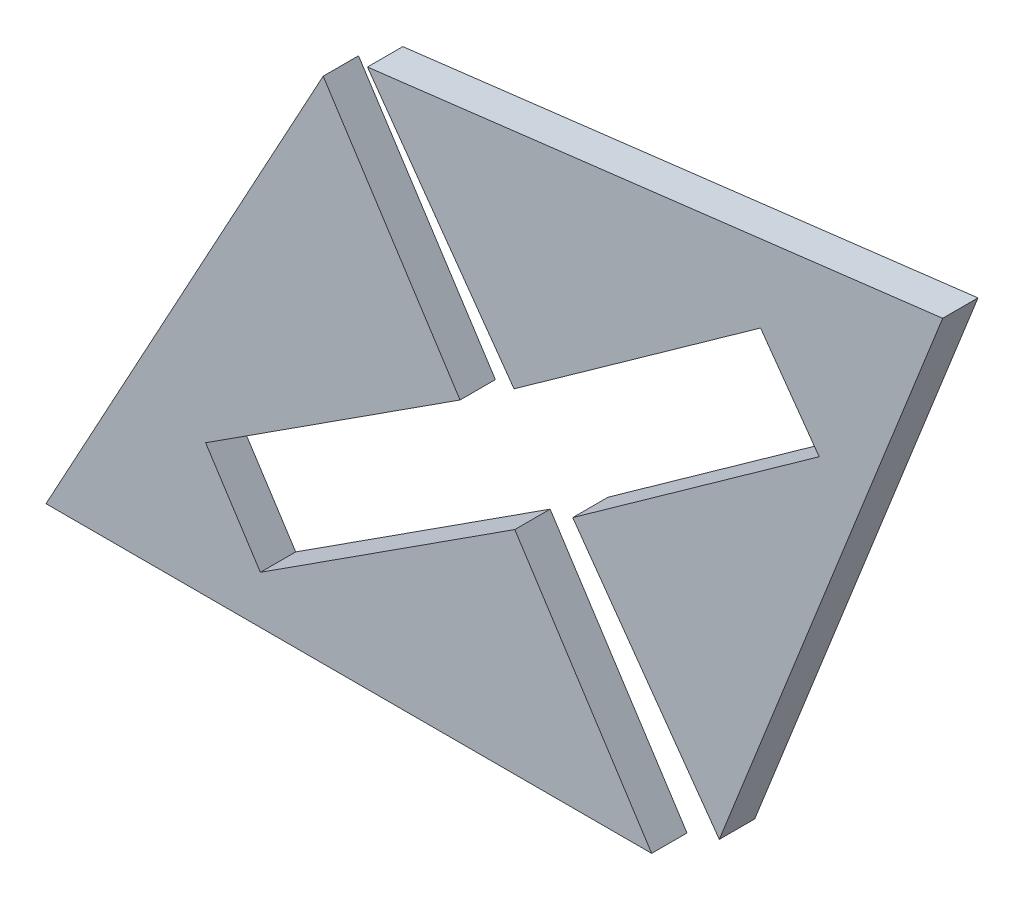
from build123d import *

# Parameters (mm, degrees)
BOSS_EXTRUDE1_DEPTH   = 3.5
BOSS_EXTRUDE1_2_DEPTH = 3.5


with BuildPart() as part:
    # Sketch1 → Boss-Extrude1 (new body)
    with BuildSketch(Plane.XY):
        Polygon((-21.72086859, 41.392598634), (-49.17932511, -9.016209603), (10.82067489, -9.016209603), (-2.73830156, 11.987460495), (-27.942705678, -4.283311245), (-33.366296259, 4.118156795), (-8.16189214, 20.388928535), align=None)
    extrude(amount=BOSS_EXTRUDE1_DEPTH)


with BuildPart() as body_2:
    # Sketch1 → Boss-Extrude1 2 (new body)
    with BuildSketch(Plane.XY):
        Polygon((-2.810819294, 24.022783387), (-17.333940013, 44.371713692), (39.647972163, 51.305433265), (17.521549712, -4.465719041), (2.998428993, 15.883211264), (27.41714536, 33.310956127), (21.607897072, 41.450528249), align=None)
    extrude(amount=BOSS_EXTRUDE1_2_DEPTH)


solid = Compound([part.part, body_2.part])
